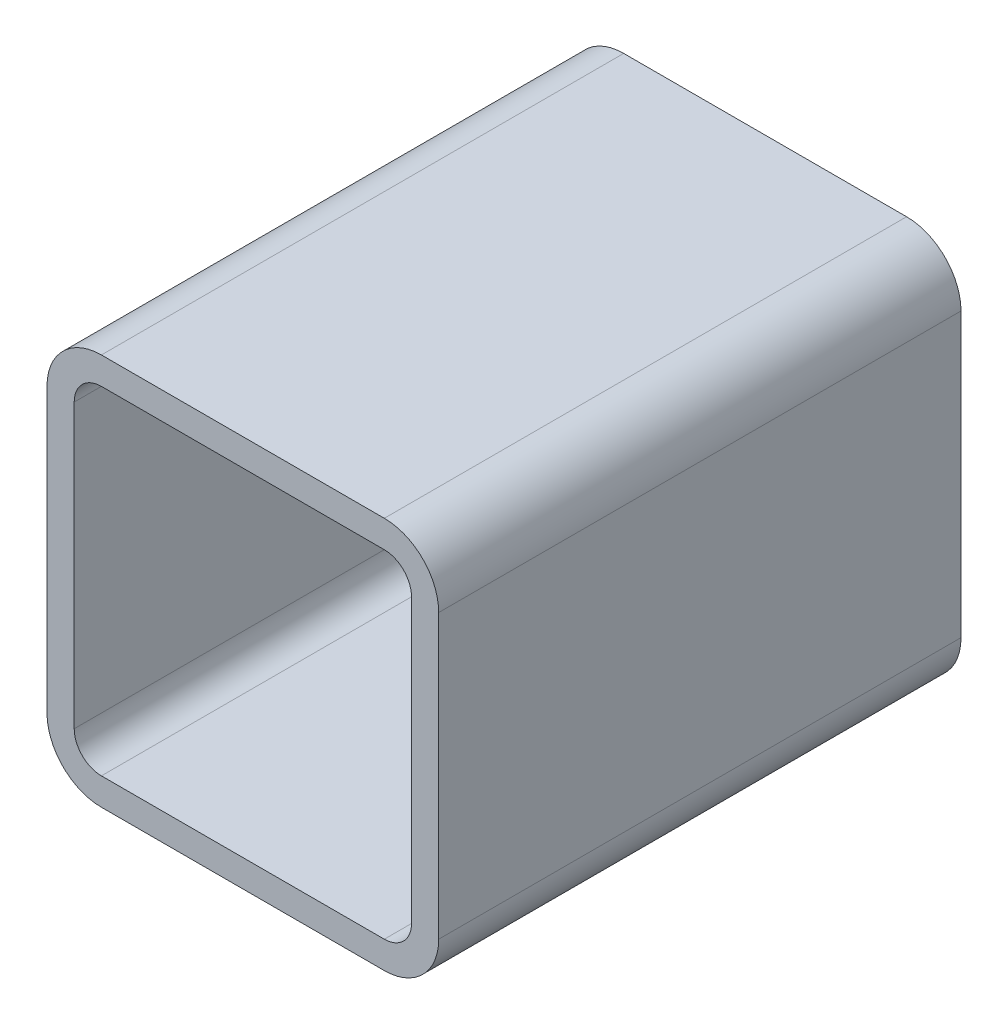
ISO-10303-21;
HEADER;
FILE_DESCRIPTION(('STEP AP214'),'2;1');
FILE_NAME('part.step','',(''),(''),'','','');
FILE_SCHEMA(('AUTOMOTIVE_DESIGN { 1 0 10303 214 1 1 1 1 }'));
ENDSEC;
DATA;
#1=APPLICATION_CONTEXT('core data for automotive mechanical design processes');
#2=APPLICATION_PROTOCOL_DEFINITION('international standard','automotive_design',2000,#1);
#3=PRODUCT_CONTEXT('',#1,'mechanical');
#4=PRODUCT('Part','Part','',(#3));
#5=PRODUCT_RELATED_PRODUCT_CATEGORY('part','',(#4));
#6=PRODUCT_DEFINITION_FORMATION('','',#4);
#7=PRODUCT_DEFINITION_CONTEXT('part definition',#1,'design');
#8=PRODUCT_DEFINITION('design','',#6,#7);
#9=PRODUCT_DEFINITION_SHAPE('','',#8);
#10=(LENGTH_UNIT() NAMED_UNIT(*) SI_UNIT(.MILLI.,.METRE.));
#11=(NAMED_UNIT(*) PLANE_ANGLE_UNIT() SI_UNIT($,.RADIAN.));
#12=(NAMED_UNIT(*) SI_UNIT($,.STERADIAN.) SOLID_ANGLE_UNIT());
#13=UNCERTAINTY_MEASURE_WITH_UNIT(LENGTH_MEASURE(1.E-05),#10,'distance_accuracy_value','');
#14=(GEOMETRIC_REPRESENTATION_CONTEXT(3) GLOBAL_UNCERTAINTY_ASSIGNED_CONTEXT((#13)) GLOBAL_UNIT_ASSIGNED_CONTEXT((#10,
#11,#12)) REPRESENTATION_CONTEXT('',''));
#15=CARTESIAN_POINT('',(0.,0.,0.));
#16=DIRECTION('',(0.,0.,1.));
#17=DIRECTION('',(1.,0.,0.));
#18=AXIS2_PLACEMENT_3D('',#15,#16,#17);
#19=CARTESIAN_POINT('',(32.3270021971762,198.793222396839,304.8));
#20=DIRECTION('',(0.,0.,1.));
#21=DIRECTION('',(1.,0.,0.));
#22=AXIS2_PLACEMENT_3D('',#19,#20,#21);
#23=PLANE('',#22);
#24=CARTESIAN_POINT('',(32.3270021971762,198.793222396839,304.8));
#25=DIRECTION('',(0.,0.,1.));
#26=DIRECTION('',(1.,0.,0.));
#27=AXIS2_PLACEMENT_3D('',#24,#25,#26);
#28=CIRCLE('',#27,31.75);
#29=CARTESIAN_POINT('',(32.3270021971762,230.543222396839,304.8));
#30=VERTEX_POINT('',#29);
#31=CARTESIAN_POINT('',(0.577002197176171,198.793222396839,304.8));
#32=VERTEX_POINT('',#31);
#33=EDGE_CURVE('E211',#30,#32,#28,.T.);
#34=ORIENTED_EDGE('',*,*,#33,.T.);
#35=DIRECTION('',(0.,-1.,0.));
#36=VECTOR('',#35,1.);
#37=CARTESIAN_POINT('',(0.577002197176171,198.793222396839,304.8));
#38=LINE('',#37,#36);
#39=CARTESIAN_POINT('',(0.577002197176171,33.6932223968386,304.8));
#40=VERTEX_POINT('',#39);
#41=EDGE_CURVE('E214',#32,#40,#38,.T.);
#42=ORIENTED_EDGE('',*,*,#41,.T.);
#43=CARTESIAN_POINT('',(32.3270021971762,33.6932223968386,304.8));
#44=DIRECTION('',(0.,0.,1.));
#45=DIRECTION('',(1.,0.,0.));
#46=AXIS2_PLACEMENT_3D('',#43,#44,#45);
#47=CIRCLE('',#46,31.75);
#48=CARTESIAN_POINT('',(32.3270021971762,1.94322239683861,304.8));
#49=VERTEX_POINT('',#48);
#50=EDGE_CURVE('E217',#40,#49,#47,.T.);
#51=ORIENTED_EDGE('',*,*,#50,.T.);
#52=DIRECTION('',(1.,0.,0.));
#53=VECTOR('',#52,1.);
#54=CARTESIAN_POINT('',(32.3270021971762,1.94322239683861,304.8));
#55=LINE('',#54,#53);
#56=CARTESIAN_POINT('',(197.427002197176,1.9432223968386,304.8));
#57=VERTEX_POINT('',#56);
#58=EDGE_CURVE('E219',#49,#57,#55,.T.);
#59=ORIENTED_EDGE('',*,*,#58,.T.);
#60=CARTESIAN_POINT('',(197.427002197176,33.6932223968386,304.8));
#61=DIRECTION('',(0.,0.,1.));
#62=DIRECTION('',(1.,0.,0.));
#63=AXIS2_PLACEMENT_3D('',#60,#61,#62);
#64=CIRCLE('',#63,31.75);
#65=CARTESIAN_POINT('',(229.177002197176,33.6932223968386,304.8));
#66=VERTEX_POINT('',#65);
#67=EDGE_CURVE('E221',#57,#66,#64,.T.);
#68=ORIENTED_EDGE('',*,*,#67,.T.);
#69=DIRECTION('',(0.,1.,0.));
#70=VECTOR('',#69,1.);
#71=CARTESIAN_POINT('',(229.177002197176,33.6932223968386,304.8));
#72=LINE('',#71,#70);
#73=CARTESIAN_POINT('',(229.177002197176,198.793222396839,304.8));
#74=VERTEX_POINT('',#73);
#75=EDGE_CURVE('E223',#66,#74,#72,.T.);
#76=ORIENTED_EDGE('',*,*,#75,.T.);
#77=CARTESIAN_POINT('',(197.427002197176,198.793222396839,304.8));
#78=DIRECTION('',(0.,0.,1.));
#79=DIRECTION('',(1.,0.,0.));
#80=AXIS2_PLACEMENT_3D('',#77,#78,#79);
#81=CIRCLE('',#80,31.75);
#82=CARTESIAN_POINT('',(197.427002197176,230.543222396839,304.8));
#83=VERTEX_POINT('',#82);
#84=EDGE_CURVE('E225',#74,#83,#81,.T.);
#85=ORIENTED_EDGE('',*,*,#84,.T.);
#86=DIRECTION('',(-1.,0.,0.));
#87=VECTOR('',#86,1.);
#88=CARTESIAN_POINT('',(197.427002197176,230.543222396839,304.8));
#89=LINE('',#88,#87);
#90=EDGE_CURVE('E227',#83,#30,#89,.T.);
#91=ORIENTED_EDGE('',*,*,#90,.T.);
#92=EDGE_LOOP('',(#34,#42,#51,#59,#68,#76,#85,#91));
#93=FACE_BOUND('',#92,.T.);
#94=DIRECTION('',(0.,-1.,0.));
#95=VECTOR('',#94,1.);
#96=CARTESIAN_POINT('',(16.4520021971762,33.6932223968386,304.8));
#97=LINE('',#96,#95);
#98=CARTESIAN_POINT('',(16.4520021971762,198.793222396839,304.8));
#99=VERTEX_POINT('',#98);
#100=CARTESIAN_POINT('',(16.4520021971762,33.6932223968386,304.8));
#101=VERTEX_POINT('',#100);
#102=EDGE_CURVE('E154',#99,#101,#97,.T.);
#103=ORIENTED_EDGE('',*,*,#102,.F.);
#104=CARTESIAN_POINT('',(32.3270021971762,198.793222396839,304.8));
#105=DIRECTION('',(0.,0.,1.));
#106=DIRECTION('',(1.,0.,0.));
#107=AXIS2_PLACEMENT_3D('',#104,#105,#106);
#108=CIRCLE('',#107,15.875);
#109=CARTESIAN_POINT('',(32.3270021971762,214.668222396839,304.8));
#110=VERTEX_POINT('',#109);
#111=EDGE_CURVE('E146',#110,#99,#108,.T.);
#112=ORIENTED_EDGE('',*,*,#111,.F.);
#113=DIRECTION('',(-1.,0.,0.));
#114=VECTOR('',#113,1.);
#115=CARTESIAN_POINT('',(32.3270021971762,214.668222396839,304.8));
#116=LINE('',#115,#114);
#117=CARTESIAN_POINT('',(197.427002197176,214.668222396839,304.8));
#118=VERTEX_POINT('',#117);
#119=EDGE_CURVE('E179',#118,#110,#116,.T.);
#120=ORIENTED_EDGE('',*,*,#119,.F.);
#121=CARTESIAN_POINT('',(197.427002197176,198.793222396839,304.8));
#122=DIRECTION('',(0.,0.,1.));
#123=DIRECTION('',(1.,0.,0.));
#124=AXIS2_PLACEMENT_3D('',#121,#122,#123);
#125=CIRCLE('',#124,15.875);
#126=CARTESIAN_POINT('',(213.302002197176,198.793222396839,304.8));
#127=VERTEX_POINT('',#126);
#128=EDGE_CURVE('E177',#127,#118,#125,.T.);
#129=ORIENTED_EDGE('',*,*,#128,.F.);
#130=DIRECTION('',(0.,1.,0.));
#131=VECTOR('',#130,1.);
#132=CARTESIAN_POINT('',(213.302002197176,198.793222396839,304.8));
#133=LINE('',#132,#131);
#134=CARTESIAN_POINT('',(213.302002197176,33.6932223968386,304.8));
#135=VERTEX_POINT('',#134);
#136=EDGE_CURVE('E175',#135,#127,#133,.T.);
#137=ORIENTED_EDGE('',*,*,#136,.F.);
#138=CARTESIAN_POINT('',(197.427002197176,33.6932223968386,304.8));
#139=DIRECTION('',(0.,0.,1.));
#140=DIRECTION('',(1.,0.,0.));
#141=AXIS2_PLACEMENT_3D('',#138,#139,#140);
#142=CIRCLE('',#141,15.875);
#143=CARTESIAN_POINT('',(197.427002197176,17.8182223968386,304.8));
#144=VERTEX_POINT('',#143);
#145=EDGE_CURVE('E173',#144,#135,#142,.T.);
#146=ORIENTED_EDGE('',*,*,#145,.F.);
#147=DIRECTION('',(1.,0.,0.));
#148=VECTOR('',#147,1.);
#149=CARTESIAN_POINT('',(197.427002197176,17.8182223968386,304.8));
#150=LINE('',#149,#148);
#151=CARTESIAN_POINT('',(32.3270021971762,17.8182223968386,304.8));
#152=VERTEX_POINT('',#151);
#153=EDGE_CURVE('E169',#152,#144,#150,.T.);
#154=ORIENTED_EDGE('',*,*,#153,.F.);
#155=CARTESIAN_POINT('',(32.3270021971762,33.6932223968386,304.8));
#156=DIRECTION('',(0.,0.,1.));
#157=DIRECTION('',(1.,0.,0.));
#158=AXIS2_PLACEMENT_3D('',#155,#156,#157);
#159=CIRCLE('',#158,15.875);
#160=EDGE_CURVE('E167',#101,#152,#159,.T.);
#161=ORIENTED_EDGE('',*,*,#160,.F.);
#162=EDGE_LOOP('',(#103,#112,#120,#129,#137,#146,#154,#161));
#163=FACE_BOUND('',#162,.T.);
#164=ADVANCED_FACE('F33',(#93,#163),#23,.T.);
#165=CARTESIAN_POINT('',(32.3270021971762,198.793222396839,0.));
#166=DIRECTION('',(0.,0.,1.));
#167=DIRECTION('',(1.,0.,0.));
#168=AXIS2_PLACEMENT_3D('',#165,#166,#167);
#169=PLANE('',#168);
#170=CARTESIAN_POINT('',(32.3270021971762,198.793222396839,0.));
#171=DIRECTION('',(0.,0.,1.));
#172=DIRECTION('',(1.,0.,0.));
#173=AXIS2_PLACEMENT_3D('',#170,#171,#172);
#174=CIRCLE('',#173,31.75);
#175=CARTESIAN_POINT('',(32.3270021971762,230.543222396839,0.));
#176=VERTEX_POINT('',#175);
#177=CARTESIAN_POINT('',(0.577002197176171,198.793222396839,0.));
#178=VERTEX_POINT('',#177);
#179=EDGE_CURVE('E162',#176,#178,#174,.T.);
#180=ORIENTED_EDGE('',*,*,#179,.F.);
#181=DIRECTION('',(-1.,0.,0.));
#182=VECTOR('',#181,1.);
#183=CARTESIAN_POINT('',(197.427002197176,230.543222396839,0.));
#184=LINE('',#183,#182);
#185=CARTESIAN_POINT('',(197.427002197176,230.543222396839,0.));
#186=VERTEX_POINT('',#185);
#187=EDGE_CURVE('E215',#186,#176,#184,.T.);
#188=ORIENTED_EDGE('',*,*,#187,.F.);
#189=CARTESIAN_POINT('',(197.427002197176,198.793222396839,0.));
#190=DIRECTION('',(0.,0.,1.));
#191=DIRECTION('',(1.,0.,0.));
#192=AXIS2_PLACEMENT_3D('',#189,#190,#191);
#193=CIRCLE('',#192,31.75);
#194=CARTESIAN_POINT('',(229.177002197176,198.793222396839,0.));
#195=VERTEX_POINT('',#194);
#196=EDGE_CURVE('E242',#195,#186,#193,.T.);
#197=ORIENTED_EDGE('',*,*,#196,.F.);
#198=DIRECTION('',(0.,1.,0.));
#199=VECTOR('',#198,1.);
#200=CARTESIAN_POINT('',(229.177002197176,33.6932223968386,0.));
#201=LINE('',#200,#199);
#202=CARTESIAN_POINT('',(229.177002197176,33.6932223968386,0.));
#203=VERTEX_POINT('',#202);
#204=EDGE_CURVE('E240',#203,#195,#201,.T.);
#205=ORIENTED_EDGE('',*,*,#204,.F.);
#206=CARTESIAN_POINT('',(197.427002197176,33.6932223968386,0.));
#207=DIRECTION('',(0.,0.,1.));
#208=DIRECTION('',(1.,0.,0.));
#209=AXIS2_PLACEMENT_3D('',#206,#207,#208);
#210=CIRCLE('',#209,31.75);
#211=CARTESIAN_POINT('',(197.427002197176,1.9432223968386,0.));
#212=VERTEX_POINT('',#211);
#213=EDGE_CURVE('E238',#212,#203,#210,.T.);
#214=ORIENTED_EDGE('',*,*,#213,.F.);
#215=DIRECTION('',(1.,0.,0.));
#216=VECTOR('',#215,1.);
#217=CARTESIAN_POINT('',(32.3270021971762,1.94322239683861,0.));
#218=LINE('',#217,#216);
#219=CARTESIAN_POINT('',(32.3270021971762,1.94322239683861,0.));
#220=VERTEX_POINT('',#219);
#221=EDGE_CURVE('E236',#220,#212,#218,.T.);
#222=ORIENTED_EDGE('',*,*,#221,.F.);
#223=CARTESIAN_POINT('',(32.3270021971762,33.6932223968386,0.));
#224=DIRECTION('',(0.,0.,1.));
#225=DIRECTION('',(1.,0.,0.));
#226=AXIS2_PLACEMENT_3D('',#223,#224,#225);
#227=CIRCLE('',#226,31.75);
#228=CARTESIAN_POINT('',(0.577002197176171,33.6932223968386,0.));
#229=VERTEX_POINT('',#228);
#230=EDGE_CURVE('E234',#229,#220,#227,.T.);
#231=ORIENTED_EDGE('',*,*,#230,.F.);
#232=DIRECTION('',(0.,-1.,0.));
#233=VECTOR('',#232,1.);
#234=CARTESIAN_POINT('',(0.577002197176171,198.793222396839,0.));
#235=LINE('',#234,#233);
#236=EDGE_CURVE('E232',#178,#229,#235,.T.);
#237=ORIENTED_EDGE('',*,*,#236,.F.);
#238=EDGE_LOOP('',(#180,#188,#197,#205,#214,#222,#231,#237));
#239=FACE_BOUND('',#238,.T.);
#240=CARTESIAN_POINT('',(32.3270021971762,198.793222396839,0.));
#241=DIRECTION('',(0.,0.,1.));
#242=DIRECTION('',(1.,0.,0.));
#243=AXIS2_PLACEMENT_3D('',#240,#241,#242);
#244=CIRCLE('',#243,15.875);
#245=CARTESIAN_POINT('',(32.3270021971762,214.668222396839,0.));
#246=VERTEX_POINT('',#245);
#247=CARTESIAN_POINT('',(16.4520021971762,198.793222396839,0.));
#248=VERTEX_POINT('',#247);
#249=EDGE_CURVE('E56',#246,#248,#244,.T.);
#250=ORIENTED_EDGE('',*,*,#249,.T.);
#251=DIRECTION('',(0.,-1.,0.));
#252=VECTOR('',#251,1.);
#253=CARTESIAN_POINT('',(16.4520021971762,33.6932223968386,0.));
#254=LINE('',#253,#252);
#255=CARTESIAN_POINT('',(16.4520021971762,33.6932223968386,0.));
#256=VERTEX_POINT('',#255);
#257=EDGE_CURVE('E161',#248,#256,#254,.T.);
#258=ORIENTED_EDGE('',*,*,#257,.T.);
#259=CARTESIAN_POINT('',(32.3270021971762,33.6932223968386,0.));
#260=DIRECTION('',(0.,0.,1.));
#261=DIRECTION('',(1.,0.,0.));
#262=AXIS2_PLACEMENT_3D('',#259,#260,#261);
#263=CIRCLE('',#262,15.875);
#264=CARTESIAN_POINT('',(32.3270021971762,17.8182223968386,0.));
#265=VERTEX_POINT('',#264);
#266=EDGE_CURVE('E183',#256,#265,#263,.T.);
#267=ORIENTED_EDGE('',*,*,#266,.T.);
#268=DIRECTION('',(1.,0.,0.));
#269=VECTOR('',#268,1.);
#270=CARTESIAN_POINT('',(197.427002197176,17.8182223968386,0.));
#271=LINE('',#270,#269);
#272=CARTESIAN_POINT('',(197.427002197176,17.8182223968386,0.));
#273=VERTEX_POINT('',#272);
#274=EDGE_CURVE('E186',#265,#273,#271,.T.);
#275=ORIENTED_EDGE('',*,*,#274,.T.);
#276=CARTESIAN_POINT('',(197.427002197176,33.6932223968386,0.));
#277=DIRECTION('',(0.,0.,1.));
#278=DIRECTION('',(1.,0.,0.));
#279=AXIS2_PLACEMENT_3D('',#276,#277,#278);
#280=CIRCLE('',#279,15.875);
#281=CARTESIAN_POINT('',(213.302002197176,33.6932223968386,0.));
#282=VERTEX_POINT('',#281);
#283=EDGE_CURVE('E189',#273,#282,#280,.T.);
#284=ORIENTED_EDGE('',*,*,#283,.T.);
#285=DIRECTION('',(0.,1.,0.));
#286=VECTOR('',#285,1.);
#287=CARTESIAN_POINT('',(213.302002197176,198.793222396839,0.));
#288=LINE('',#287,#286);
#289=CARTESIAN_POINT('',(213.302002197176,198.793222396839,0.));
#290=VERTEX_POINT('',#289);
#291=EDGE_CURVE('E192',#282,#290,#288,.T.);
#292=ORIENTED_EDGE('',*,*,#291,.T.);
#293=CARTESIAN_POINT('',(197.427002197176,198.793222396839,0.));
#294=DIRECTION('',(0.,0.,1.));
#295=DIRECTION('',(1.,0.,0.));
#296=AXIS2_PLACEMENT_3D('',#293,#294,#295);
#297=CIRCLE('',#296,15.875);
#298=CARTESIAN_POINT('',(197.427002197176,214.668222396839,0.));
#299=VERTEX_POINT('',#298);
#300=EDGE_CURVE('E195',#290,#299,#297,.T.);
#301=ORIENTED_EDGE('',*,*,#300,.T.);
#302=DIRECTION('',(-1.,0.,0.));
#303=VECTOR('',#302,1.);
#304=CARTESIAN_POINT('',(32.3270021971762,214.668222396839,0.));
#305=LINE('',#304,#303);
#306=EDGE_CURVE('E155',#299,#246,#305,.T.);
#307=ORIENTED_EDGE('',*,*,#306,.T.);
#308=EDGE_LOOP('',(#250,#258,#267,#275,#284,#292,#301,#307));
#309=FACE_BOUND('',#308,.T.);
#310=ADVANCED_FACE('F272',(#239,#309),#169,.F.);
#311=CARTESIAN_POINT('',(32.3270021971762,198.793222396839,304.8));
#312=DIRECTION('',(0.,0.,-1.));
#313=DIRECTION('',(-1.,0.,0.));
#314=AXIS2_PLACEMENT_3D('',#311,#312,#313);
#315=CYLINDRICAL_SURFACE('',#314,31.75);
#316=ORIENTED_EDGE('',*,*,#179,.T.);
#317=DIRECTION('',(0.,0.,-1.));
#318=VECTOR('',#317,1.);
#319=CARTESIAN_POINT('',(0.577002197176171,198.793222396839,304.8));
#320=LINE('',#319,#318);
#321=EDGE_CURVE('E11',#32,#178,#320,.T.);
#322=ORIENTED_EDGE('',*,*,#321,.F.);
#323=ORIENTED_EDGE('',*,*,#33,.F.);
#324=DIRECTION('',(0.,0.,-1.));
#325=VECTOR('',#324,1.);
#326=CARTESIAN_POINT('',(32.3270021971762,230.543222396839,304.8));
#327=LINE('',#326,#325);
#328=EDGE_CURVE('E229',#30,#176,#327,.T.);
#329=ORIENTED_EDGE('',*,*,#328,.T.);
#330=EDGE_LOOP('',(#316,#322,#323,#329));
#331=FACE_BOUND('',#330,.T.);
#332=ADVANCED_FACE('F35',(#331),#315,.T.);
#333=CARTESIAN_POINT('',(0.577002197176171,198.793222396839,304.8));
#334=DIRECTION('',(1.,0.,0.));
#335=DIRECTION('',(0.,0.,-1.));
#336=AXIS2_PLACEMENT_3D('',#333,#334,#335);
#337=PLANE('',#336);
#338=ORIENTED_EDGE('',*,*,#236,.T.);
#339=DIRECTION('',(0.,0.,-1.));
#340=VECTOR('',#339,1.);
#341=CARTESIAN_POINT('',(0.577002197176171,33.6932223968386,304.8));
#342=LINE('',#341,#340);
#343=EDGE_CURVE('E41',#40,#229,#342,.T.);
#344=ORIENTED_EDGE('',*,*,#343,.F.);
#345=ORIENTED_EDGE('',*,*,#41,.F.);
#346=ORIENTED_EDGE('',*,*,#321,.T.);
#347=EDGE_LOOP('',(#338,#344,#345,#346));
#348=FACE_BOUND('',#347,.T.);
#349=ADVANCED_FACE('F289',(#348),#337,.F.);
#350=CARTESIAN_POINT('',(32.3270021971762,33.6932223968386,304.8));
#351=DIRECTION('',(0.,0.,-1.));
#352=DIRECTION('',(-1.,0.,0.));
#353=AXIS2_PLACEMENT_3D('',#350,#351,#352);
#354=CYLINDRICAL_SURFACE('',#353,31.75);
#355=ORIENTED_EDGE('',*,*,#230,.T.);
#356=DIRECTION('',(0.,0.,-1.));
#357=VECTOR('',#356,1.);
#358=CARTESIAN_POINT('',(32.3270021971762,1.94322239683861,304.8));
#359=LINE('',#358,#357);
#360=EDGE_CURVE('E259',#49,#220,#359,.T.);
#361=ORIENTED_EDGE('',*,*,#360,.F.);
#362=ORIENTED_EDGE('',*,*,#50,.F.);
#363=ORIENTED_EDGE('',*,*,#343,.T.);
#364=EDGE_LOOP('',(#355,#361,#362,#363));
#365=FACE_BOUND('',#364,.T.);
#366=ADVANCED_FACE('F266',(#365),#354,.T.);
#367=CARTESIAN_POINT('',(32.3270021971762,1.94322239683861,304.8));
#368=DIRECTION('',(0.,1.,0.));
#369=DIRECTION('',(0.,0.,1.));
#370=AXIS2_PLACEMENT_3D('',#367,#368,#369);
#371=PLANE('',#370);
#372=ORIENTED_EDGE('',*,*,#221,.T.);
#373=DIRECTION('',(0.,0.,-1.));
#374=VECTOR('',#373,1.);
#375=CARTESIAN_POINT('',(197.427002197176,1.9432223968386,304.8));
#376=LINE('',#375,#374);
#377=EDGE_CURVE('E256',#57,#212,#376,.T.);
#378=ORIENTED_EDGE('',*,*,#377,.F.);
#379=ORIENTED_EDGE('',*,*,#58,.F.);
#380=ORIENTED_EDGE('',*,*,#360,.T.);
#381=EDGE_LOOP('',(#372,#378,#379,#380));
#382=FACE_BOUND('',#381,.T.);
#383=ADVANCED_FACE('F278',(#382),#371,.F.);
#384=CARTESIAN_POINT('',(197.427002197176,33.6932223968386,304.8));
#385=DIRECTION('',(0.,0.,-1.));
#386=DIRECTION('',(-1.,0.,0.));
#387=AXIS2_PLACEMENT_3D('',#384,#385,#386);
#388=CYLINDRICAL_SURFACE('',#387,31.75);
#389=ORIENTED_EDGE('',*,*,#213,.T.);
#390=DIRECTION('',(0.,0.,-1.));
#391=VECTOR('',#390,1.);
#392=CARTESIAN_POINT('',(229.177002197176,33.6932223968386,304.8));
#393=LINE('',#392,#391);
#394=EDGE_CURVE('E253',#66,#203,#393,.T.);
#395=ORIENTED_EDGE('',*,*,#394,.F.);
#396=ORIENTED_EDGE('',*,*,#67,.F.);
#397=ORIENTED_EDGE('',*,*,#377,.T.);
#398=EDGE_LOOP('',(#389,#395,#396,#397));
#399=FACE_BOUND('',#398,.T.);
#400=ADVANCED_FACE('F282',(#399),#388,.T.);
#401=CARTESIAN_POINT('',(229.177002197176,33.6932223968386,304.8));
#402=DIRECTION('',(-1.,0.,0.));
#403=DIRECTION('',(0.,0.,1.));
#404=AXIS2_PLACEMENT_3D('',#401,#402,#403);
#405=PLANE('',#404);
#406=ORIENTED_EDGE('',*,*,#204,.T.);
#407=DIRECTION('',(0.,0.,-1.));
#408=VECTOR('',#407,1.);
#409=CARTESIAN_POINT('',(229.177002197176,198.793222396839,304.8));
#410=LINE('',#409,#408);
#411=EDGE_CURVE('E250',#74,#195,#410,.T.);
#412=ORIENTED_EDGE('',*,*,#411,.F.);
#413=ORIENTED_EDGE('',*,*,#75,.F.);
#414=ORIENTED_EDGE('',*,*,#394,.T.);
#415=EDGE_LOOP('',(#406,#412,#413,#414));
#416=FACE_BOUND('',#415,.T.);
#417=ADVANCED_FACE('F302',(#416),#405,.F.);
#418=CARTESIAN_POINT('',(197.427002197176,198.793222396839,304.8));
#419=DIRECTION('',(0.,0.,-1.));
#420=DIRECTION('',(-1.,0.,0.));
#421=AXIS2_PLACEMENT_3D('',#418,#419,#420);
#422=CYLINDRICAL_SURFACE('',#421,31.75);
#423=ORIENTED_EDGE('',*,*,#196,.T.);
#424=DIRECTION('',(0.,0.,-1.));
#425=VECTOR('',#424,1.);
#426=CARTESIAN_POINT('',(197.427002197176,230.543222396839,304.8));
#427=LINE('',#426,#425);
#428=EDGE_CURVE('E247',#83,#186,#427,.T.);
#429=ORIENTED_EDGE('',*,*,#428,.F.);
#430=ORIENTED_EDGE('',*,*,#84,.F.);
#431=ORIENTED_EDGE('',*,*,#411,.T.);
#432=EDGE_LOOP('',(#423,#429,#430,#431));
#433=FACE_BOUND('',#432,.T.);
#434=ADVANCED_FACE('F300',(#433),#422,.T.);
#435=CARTESIAN_POINT('',(197.427002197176,230.543222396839,304.8));
#436=DIRECTION('',(0.,-1.,0.));
#437=DIRECTION('',(0.,0.,-1.));
#438=AXIS2_PLACEMENT_3D('',#435,#436,#437);
#439=PLANE('',#438);
#440=ORIENTED_EDGE('',*,*,#187,.T.);
#441=ORIENTED_EDGE('',*,*,#328,.F.);
#442=ORIENTED_EDGE('',*,*,#90,.F.);
#443=ORIENTED_EDGE('',*,*,#428,.T.);
#444=EDGE_LOOP('',(#440,#441,#442,#443));
#445=FACE_BOUND('',#444,.T.);
#446=ADVANCED_FACE('F295',(#445),#439,.F.);
#447=CARTESIAN_POINT('',(32.3270021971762,198.793222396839,304.8));
#448=DIRECTION('',(0.,0.,-1.));
#449=DIRECTION('',(-1.,0.,0.));
#450=AXIS2_PLACEMENT_3D('',#447,#448,#449);
#451=CYLINDRICAL_SURFACE('',#450,15.875);
#452=ORIENTED_EDGE('',*,*,#249,.F.);
#453=DIRECTION('',(0.,0.,-1.));
#454=VECTOR('',#453,1.);
#455=CARTESIAN_POINT('',(32.3270021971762,214.668222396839,304.8));
#456=LINE('',#455,#454);
#457=EDGE_CURVE('E150',#110,#246,#456,.T.);
#458=ORIENTED_EDGE('',*,*,#457,.F.);
#459=ORIENTED_EDGE('',*,*,#111,.T.);
#460=DIRECTION('',(0.,0.,-1.));
#461=VECTOR('',#460,1.);
#462=CARTESIAN_POINT('',(16.4520021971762,198.793222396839,304.8));
#463=LINE('',#462,#461);
#464=EDGE_CURVE('E149',#99,#248,#463,.T.);
#465=ORIENTED_EDGE('',*,*,#464,.T.);
#466=EDGE_LOOP('',(#452,#458,#459,#465));
#467=FACE_BOUND('',#466,.T.);
#468=ADVANCED_FACE('F148',(#467),#451,.F.);
#469=CARTESIAN_POINT('',(16.4520021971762,33.6932223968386,304.8));
#470=DIRECTION('',(1.,0.,0.));
#471=DIRECTION('',(0.,0.,-1.));
#472=AXIS2_PLACEMENT_3D('',#469,#470,#471);
#473=PLANE('',#472);
#474=ORIENTED_EDGE('',*,*,#257,.F.);
#475=ORIENTED_EDGE('',*,*,#464,.F.);
#476=ORIENTED_EDGE('',*,*,#102,.T.);
#477=DIRECTION('',(0.,0.,-1.));
#478=VECTOR('',#477,1.);
#479=CARTESIAN_POINT('',(16.4520021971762,33.6932223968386,304.8));
#480=LINE('',#479,#478);
#481=EDGE_CURVE('E163',#101,#256,#480,.T.);
#482=ORIENTED_EDGE('',*,*,#481,.T.);
#483=EDGE_LOOP('',(#474,#475,#476,#482));
#484=FACE_BOUND('',#483,.T.);
#485=ADVANCED_FACE('F158',(#484),#473,.T.);
#486=CARTESIAN_POINT('',(32.3270021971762,33.6932223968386,304.8));
#487=DIRECTION('',(0.,0.,-1.));
#488=DIRECTION('',(-1.,0.,0.));
#489=AXIS2_PLACEMENT_3D('',#486,#487,#488);
#490=CYLINDRICAL_SURFACE('',#489,15.875);
#491=ORIENTED_EDGE('',*,*,#266,.F.);
#492=ORIENTED_EDGE('',*,*,#481,.F.);
#493=ORIENTED_EDGE('',*,*,#160,.T.);
#494=DIRECTION('',(0.,0.,-1.));
#495=VECTOR('',#494,1.);
#496=CARTESIAN_POINT('',(32.3270021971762,17.8182223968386,304.8));
#497=LINE('',#496,#495);
#498=EDGE_CURVE('E208',#152,#265,#497,.T.);
#499=ORIENTED_EDGE('',*,*,#498,.T.);
#500=EDGE_LOOP('',(#491,#492,#493,#499));
#501=FACE_BOUND('',#500,.T.);
#502=ADVANCED_FACE('F327',(#501),#490,.F.);
#503=CARTESIAN_POINT('',(197.427002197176,17.8182223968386,304.8));
#504=DIRECTION('',(0.,1.,0.));
#505=DIRECTION('',(0.,0.,1.));
#506=AXIS2_PLACEMENT_3D('',#503,#504,#505);
#507=PLANE('',#506);
#508=ORIENTED_EDGE('',*,*,#274,.F.);
#509=ORIENTED_EDGE('',*,*,#498,.F.);
#510=ORIENTED_EDGE('',*,*,#153,.T.);
#511=DIRECTION('',(0.,0.,-1.));
#512=VECTOR('',#511,1.);
#513=CARTESIAN_POINT('',(197.427002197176,17.8182223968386,304.8));
#514=LINE('',#513,#512);
#515=EDGE_CURVE('E206',#144,#273,#514,.T.);
#516=ORIENTED_EDGE('',*,*,#515,.T.);
#517=EDGE_LOOP('',(#508,#509,#510,#516));
#518=FACE_BOUND('',#517,.T.);
#519=ADVANCED_FACE('F331',(#518),#507,.T.);
#520=CARTESIAN_POINT('',(197.427002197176,33.6932223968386,304.8));
#521=DIRECTION('',(0.,0.,-1.));
#522=DIRECTION('',(-1.,0.,0.));
#523=AXIS2_PLACEMENT_3D('',#520,#521,#522);
#524=CYLINDRICAL_SURFACE('',#523,15.875);
#525=ORIENTED_EDGE('',*,*,#283,.F.);
#526=ORIENTED_EDGE('',*,*,#515,.F.);
#527=ORIENTED_EDGE('',*,*,#145,.T.);
#528=DIRECTION('',(0.,0.,-1.));
#529=VECTOR('',#528,1.);
#530=CARTESIAN_POINT('',(213.302002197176,33.6932223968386,304.8));
#531=LINE('',#530,#529);
#532=EDGE_CURVE('E204',#135,#282,#531,.T.);
#533=ORIENTED_EDGE('',*,*,#532,.T.);
#534=EDGE_LOOP('',(#525,#526,#527,#533));
#535=FACE_BOUND('',#534,.T.);
#536=ADVANCED_FACE('F337',(#535),#524,.F.);
#537=CARTESIAN_POINT('',(213.302002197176,198.793222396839,304.8));
#538=DIRECTION('',(-1.,0.,0.));
#539=DIRECTION('',(0.,0.,1.));
#540=AXIS2_PLACEMENT_3D('',#537,#538,#539);
#541=PLANE('',#540);
#542=ORIENTED_EDGE('',*,*,#291,.F.);
#543=ORIENTED_EDGE('',*,*,#532,.F.);
#544=ORIENTED_EDGE('',*,*,#136,.T.);
#545=DIRECTION('',(0.,0.,-1.));
#546=VECTOR('',#545,1.);
#547=CARTESIAN_POINT('',(213.302002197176,198.793222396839,304.8));
#548=LINE('',#547,#546);
#549=EDGE_CURVE('E202',#127,#290,#548,.T.);
#550=ORIENTED_EDGE('',*,*,#549,.T.);
#551=EDGE_LOOP('',(#542,#543,#544,#550));
#552=FACE_BOUND('',#551,.T.);
#553=ADVANCED_FACE('F341',(#552),#541,.T.);
#554=CARTESIAN_POINT('',(197.427002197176,198.793222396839,304.8));
#555=DIRECTION('',(0.,0.,-1.));
#556=DIRECTION('',(-1.,0.,0.));
#557=AXIS2_PLACEMENT_3D('',#554,#555,#556);
#558=CYLINDRICAL_SURFACE('',#557,15.875);
#559=ORIENTED_EDGE('',*,*,#300,.F.);
#560=ORIENTED_EDGE('',*,*,#549,.F.);
#561=ORIENTED_EDGE('',*,*,#128,.T.);
#562=DIRECTION('',(0.,0.,-1.));
#563=VECTOR('',#562,1.);
#564=CARTESIAN_POINT('',(197.427002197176,214.668222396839,304.8));
#565=LINE('',#564,#563);
#566=EDGE_CURVE('E48',#118,#299,#565,.T.);
#567=ORIENTED_EDGE('',*,*,#566,.T.);
#568=EDGE_LOOP('',(#559,#560,#561,#567));
#569=FACE_BOUND('',#568,.T.);
#570=ADVANCED_FACE('F345',(#569),#558,.F.);
#571=CARTESIAN_POINT('',(32.3270021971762,214.668222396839,304.8));
#572=DIRECTION('',(0.,-1.,0.));
#573=DIRECTION('',(0.,0.,-1.));
#574=AXIS2_PLACEMENT_3D('',#571,#572,#573);
#575=PLANE('',#574);
#576=ORIENTED_EDGE('',*,*,#306,.F.);
#577=ORIENTED_EDGE('',*,*,#566,.F.);
#578=ORIENTED_EDGE('',*,*,#119,.T.);
#579=ORIENTED_EDGE('',*,*,#457,.T.);
#580=EDGE_LOOP('',(#576,#577,#578,#579));
#581=FACE_BOUND('',#580,.T.);
#582=ADVANCED_FACE('F349',(#581),#575,.T.);
#583=CLOSED_SHELL('',(#164,#310,#332,#349,#366,#383,#400,#417,#434,#446,#468,#485,#502,#519,
#536,#553,#570,#582));
#584=MANIFOLD_SOLID_BREP('B2',#583);
#585=ADVANCED_BREP_SHAPE_REPRESENTATION('',(#18,#584),#14);
#586=SHAPE_DEFINITION_REPRESENTATION(#9,#585);
ENDSEC;
END-ISO-10303-21;
